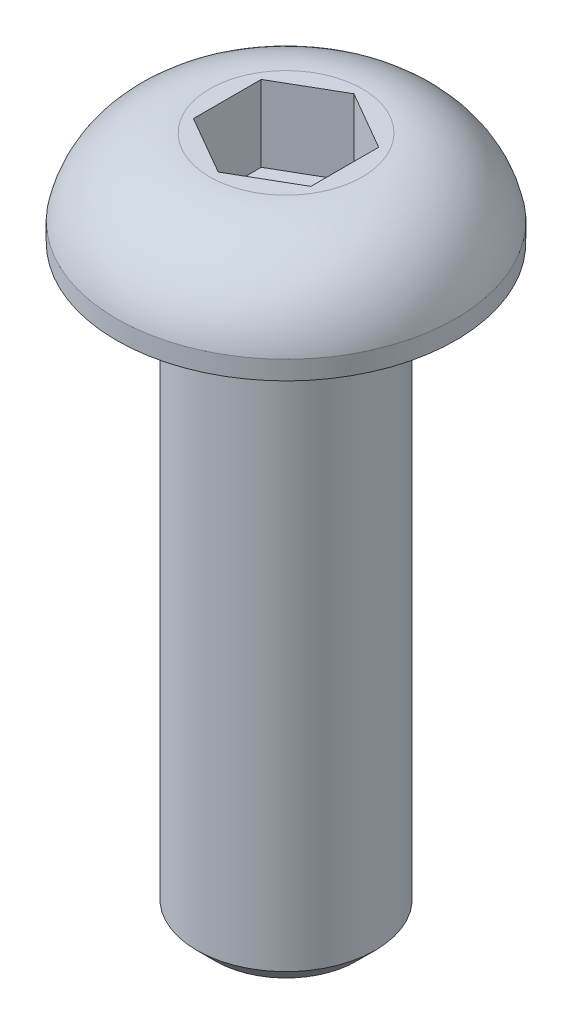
ISO-10303-21;
HEADER;
FILE_DESCRIPTION(('STEP AP214'),'2;1');
FILE_NAME('part.step','',(''),(''),'','','');
FILE_SCHEMA(('AUTOMOTIVE_DESIGN { 1 0 10303 214 1 1 1 1 }'));
ENDSEC;
DATA;
#1=APPLICATION_CONTEXT('core data for automotive mechanical design processes');
#2=APPLICATION_PROTOCOL_DEFINITION('international standard','automotive_design',2000,#1);
#3=PRODUCT_CONTEXT('',#1,'mechanical');
#4=PRODUCT('Part','Part','',(#3));
#5=PRODUCT_RELATED_PRODUCT_CATEGORY('part','',(#4));
#6=PRODUCT_DEFINITION_FORMATION('','',#4);
#7=PRODUCT_DEFINITION_CONTEXT('part definition',#1,'design');
#8=PRODUCT_DEFINITION('design','',#6,#7);
#9=PRODUCT_DEFINITION_SHAPE('','',#8);
#10=(LENGTH_UNIT() NAMED_UNIT(*) SI_UNIT(.MILLI.,.METRE.));
#11=(NAMED_UNIT(*) PLANE_ANGLE_UNIT() SI_UNIT($,.RADIAN.));
#12=(NAMED_UNIT(*) SI_UNIT($,.STERADIAN.) SOLID_ANGLE_UNIT());
#13=UNCERTAINTY_MEASURE_WITH_UNIT(LENGTH_MEASURE(1.E-05),#10,'distance_accuracy_value','');
#14=(GEOMETRIC_REPRESENTATION_CONTEXT(3) GLOBAL_UNCERTAINTY_ASSIGNED_CONTEXT((#13)) GLOBAL_UNIT_ASSIGNED_CONTEXT((#10,
#11,#12)) REPRESENTATION_CONTEXT('',''));
#15=CARTESIAN_POINT('',(0.,0.,0.));
#16=DIRECTION('',(0.,0.,1.));
#17=DIRECTION('',(1.,0.,0.));
#18=AXIS2_PLACEMENT_3D('',#15,#16,#17);
#19=CARTESIAN_POINT('',(0.,0.,0.));
#20=DIRECTION('',(0.,0.999999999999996,0.));
#21=DIRECTION('',(0.,0.,0.999999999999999));
#22=AXIS2_PLACEMENT_3D('',#19,#20,#21);
#23=PLANE('',#22);
#24=DIRECTION('',(0.,0.,0.999999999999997));
#25=VECTOR('',#24,1.);
#26=CARTESIAN_POINT('',(-1.58749999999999,0.,-0.916543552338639));
#27=LINE('',#26,#25);
#28=CARTESIAN_POINT('',(-1.58749999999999,0.,-0.916543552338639));
#29=VERTEX_POINT('',#28);
#30=CARTESIAN_POINT('',(-1.58749999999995,0.,0.916543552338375));
#31=VERTEX_POINT('',#30);
#32=EDGE_CURVE('E53',#29,#31,#27,.T.);
#33=ORIENTED_EDGE('',*,*,#32,.F.);
#34=DIRECTION('',(-0.866025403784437,0.,0.499999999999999));
#35=VECTOR('',#34,1.);
#36=CARTESIAN_POINT('',(0.,0.,-1.83308710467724));
#37=LINE('',#36,#35);
#38=CARTESIAN_POINT('',(0.,0.,-1.83308710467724));
#39=VERTEX_POINT('',#38);
#40=EDGE_CURVE('E138',#39,#29,#37,.T.);
#41=ORIENTED_EDGE('',*,*,#40,.F.);
#42=DIRECTION('',(0.866025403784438,0.,0.5));
#43=VECTOR('',#42,1.);
#44=CARTESIAN_POINT('',(0.,0.,-1.83308710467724));
#45=LINE('',#44,#43);
#46=CARTESIAN_POINT('',(1.58749999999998,0.,-0.916543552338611));
#47=VERTEX_POINT('',#46);
#48=EDGE_CURVE('E136',#39,#47,#45,.T.);
#49=ORIENTED_EDGE('',*,*,#48,.T.);
#50=DIRECTION('',(0.,0.,0.999999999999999));
#51=VECTOR('',#50,1.);
#52=CARTESIAN_POINT('',(1.58749999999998,0.,-0.916543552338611));
#53=LINE('',#52,#51);
#54=CARTESIAN_POINT('',(1.58749999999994,0.,0.916543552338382));
#55=VERTEX_POINT('',#54);
#56=EDGE_CURVE('E112',#47,#55,#53,.T.);
#57=ORIENTED_EDGE('',*,*,#56,.T.);
#58=DIRECTION('',(0.866025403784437,0.,-0.499999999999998));
#59=VECTOR('',#58,1.);
#60=CARTESIAN_POINT('',(0.,0.,1.83308710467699));
#61=LINE('',#60,#59);
#62=CARTESIAN_POINT('',(0.,0.,1.83308710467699));
#63=VERTEX_POINT('',#62);
#64=EDGE_CURVE('E132',#63,#55,#61,.T.);
#65=ORIENTED_EDGE('',*,*,#64,.F.);
#66=DIRECTION('',(-0.866025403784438,0.,-0.5));
#67=VECTOR('',#66,1.);
#68=CARTESIAN_POINT('',(0.,0.,1.83308710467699));
#69=LINE('',#68,#67);
#70=EDGE_CURVE('E128',#63,#31,#69,.T.);
#71=ORIENTED_EDGE('',*,*,#70,.T.);
#72=EDGE_LOOP('',(#33,#41,#49,#57,#65,#71));
#73=FACE_BOUND('',#72,.T.);
#74=CARTESIAN_POINT('',(0.,0.,0.));
#75=DIRECTION('',(0.,0.999999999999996,0.));
#76=DIRECTION('',(0.,0.,0.999999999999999));
#77=AXIS2_PLACEMENT_3D('',#74,#75,#76);
#78=CIRCLE('',#77,2.06375);
#79=CARTESIAN_POINT('',(0.,0.,2.06375));
#80=VERTEX_POINT('',#79);
#81=EDGE_CURVE('E156',#80,#80,#78,.T.);
#82=ORIENTED_EDGE('',*,*,#81,.T.);
#83=EDGE_LOOP('',(#82));
#84=FACE_BOUND('',#83,.T.);
#85=ADVANCED_FACE('F38',(#73,#84),#23,.T.);
#86=CARTESIAN_POINT('',(0.,-2.57317091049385,-1.11022302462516E-13));
#87=DIRECTION('',(0.,0.999999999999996,0.));
#88=DIRECTION('',(0.,0.,0.999999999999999));
#89=AXIS2_PLACEMENT_3D('',#86,#87,#88);
#90=DEGENERATE_TOROIDAL_SURFACE('',#89,2.06375,2.57317091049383,.T.);
#91=CARTESIAN_POINT('',(0.,-2.05739999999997,-1.94289029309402E-13));
#92=DIRECTION('',(0.,0.999999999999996,0.));
#93=DIRECTION('',(0.,0.,0.999999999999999));
#94=AXIS2_PLACEMENT_3D('',#91,#92,#93);
#95=CIRCLE('',#94,4.5847);
#96=CARTESIAN_POINT('',(1.24273463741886E-13,-2.05739999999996,4.58469999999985));
#97=VERTEX_POINT('',#96);
#98=EDGE_CURVE('E153',#97,#97,#95,.T.);
#99=ORIENTED_EDGE('',*,*,#98,.T.);
#100=EDGE_LOOP('',(#99));
#101=FACE_BOUND('',#100,.T.);
#102=ORIENTED_EDGE('',*,*,#81,.F.);
#103=EDGE_LOOP('',(#102));
#104=FACE_BOUND('',#103,.T.);
#105=ADVANCED_FACE('F177',(#101,#104),#90,.T.);
#106=CARTESIAN_POINT('',(1.80411241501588E-13,25.3999999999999,-2.15105711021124E-13));
#107=DIRECTION('',(0.,0.999999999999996,0.));
#108=DIRECTION('',(0.,0.,0.999999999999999));
#109=AXIS2_PLACEMENT_3D('',#106,#107,#108);
#110=CYLINDRICAL_SURFACE('',#109,4.5847);
#111=CARTESIAN_POINT('',(1.52655665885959E-13,-2.56539999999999,-1.17961196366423E-13));
#112=DIRECTION('',(0.,0.999999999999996,0.));
#113=DIRECTION('',(0.,0.,0.999999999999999));
#114=AXIS2_PLACEMENT_3D('',#111,#112,#113);
#115=CIRCLE('',#114,4.5847);
#116=CARTESIAN_POINT('',(1.23201876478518E-13,-2.56539999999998,4.58469999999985));
#117=VERTEX_POINT('',#116);
#118=EDGE_CURVE('E150',#117,#117,#115,.T.);
#119=CARTESIAN_POINT('',(1.23201876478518E-13,-2.56539999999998,4.58469999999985));
#120=CARTESIAN_POINT('',(1.23213038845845E-13,-2.56010833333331,4.58469999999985));
#121=CARTESIAN_POINT('',(1.23224201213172E-13,-2.55481666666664,4.58469999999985));
#122=CARTESIAN_POINT('',(1.23246525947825E-13,-2.54423333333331,4.58469999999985));
#123=CARTESIAN_POINT('',(1.23257688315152E-13,-2.53894166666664,4.58469999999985));
#124=CARTESIAN_POINT('',(1.23280013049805E-13,-2.52835833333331,4.58469999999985));
#125=CARTESIAN_POINT('',(1.23291175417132E-13,-2.52306666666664,4.58469999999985));
#126=CARTESIAN_POINT('',(1.23313500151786E-13,-2.51248333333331,4.58469999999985));
#127=CARTESIAN_POINT('',(1.23324662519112E-13,-2.50719166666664,4.58469999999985));
#128=CARTESIAN_POINT('',(1.23346987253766E-13,-2.49660833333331,4.58469999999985));
#129=CARTESIAN_POINT('',(1.23358149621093E-13,-2.49131666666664,4.58469999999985));
#130=CARTESIAN_POINT('',(1.23380474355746E-13,-2.48073333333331,4.58469999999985));
#131=CARTESIAN_POINT('',(1.23391636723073E-13,-2.47544166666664,4.58469999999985));
#132=CARTESIAN_POINT('',(1.23413961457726E-13,-2.46485833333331,4.58469999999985));
#133=CARTESIAN_POINT('',(1.23425123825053E-13,-2.45956666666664,4.58469999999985));
#134=CARTESIAN_POINT('',(1.23447448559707E-13,-2.44898333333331,4.58469999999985));
#135=CARTESIAN_POINT('',(1.23458610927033E-13,-2.44369166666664,4.58469999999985));
#136=CARTESIAN_POINT('',(1.23480935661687E-13,-2.43310833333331,4.58469999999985));
#137=CARTESIAN_POINT('',(1.23492098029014E-13,-2.42781666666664,4.58469999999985));
#138=CARTESIAN_POINT('',(1.23514422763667E-13,-2.4172333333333,4.58469999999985));
#139=CARTESIAN_POINT('',(1.23525585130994E-13,-2.41194166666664,4.58469999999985));
#140=CARTESIAN_POINT('',(1.23547909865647E-13,-2.4013583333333,4.58469999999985));
#141=CARTESIAN_POINT('',(1.23559072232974E-13,-2.39606666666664,4.58469999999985));
#142=CARTESIAN_POINT('',(1.23581396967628E-13,-2.3854833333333,4.58469999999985));
#143=CARTESIAN_POINT('',(1.23592559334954E-13,-2.38019166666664,4.58469999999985));
#144=CARTESIAN_POINT('',(1.23614884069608E-13,-2.3696083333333,4.58469999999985));
#145=CARTESIAN_POINT('',(1.23626046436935E-13,-2.36431666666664,4.58469999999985));
#146=CARTESIAN_POINT('',(1.23648371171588E-13,-2.3537333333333,4.58469999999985));
#147=CARTESIAN_POINT('',(1.23659533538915E-13,-2.34844166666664,4.58469999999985));
#148=CARTESIAN_POINT('',(1.23681858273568E-13,-2.3378583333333,4.58469999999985));
#149=CARTESIAN_POINT('',(1.23693020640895E-13,-2.33256666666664,4.58469999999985));
#150=CARTESIAN_POINT('',(1.23715345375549E-13,-2.32198333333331,4.58469999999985));
#151=CARTESIAN_POINT('',(1.23726507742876E-13,-2.31669166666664,4.58469999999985));
#152=CARTESIAN_POINT('',(1.23748832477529E-13,-2.3061083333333,4.58469999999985));
#153=CARTESIAN_POINT('',(1.23759994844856E-13,-2.30081666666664,4.58469999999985));
#154=CARTESIAN_POINT('',(1.23782319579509E-13,-2.2902333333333,4.58469999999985));
#155=CARTESIAN_POINT('',(1.23793481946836E-13,-2.28494166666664,4.58469999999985));
#156=CARTESIAN_POINT('',(1.2381580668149E-13,-2.2743583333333,4.58469999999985));
#157=CARTESIAN_POINT('',(1.23826969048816E-13,-2.26906666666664,4.58469999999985));
#158=CARTESIAN_POINT('',(1.2384929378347E-13,-2.2584833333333,4.58469999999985));
#159=CARTESIAN_POINT('',(1.23860456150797E-13,-2.25319166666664,4.58469999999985));
#160=CARTESIAN_POINT('',(1.2388278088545E-13,-2.2426083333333,4.58469999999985));
#161=CARTESIAN_POINT('',(1.23893943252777E-13,-2.23731666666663,4.58469999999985));
#162=CARTESIAN_POINT('',(1.2391626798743E-13,-2.2267333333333,4.58469999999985));
#163=CARTESIAN_POINT('',(1.23927430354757E-13,-2.22144166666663,4.58469999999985));
#164=CARTESIAN_POINT('',(1.23949755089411E-13,-2.2108583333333,4.58469999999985));
#165=CARTESIAN_POINT('',(1.23960917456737E-13,-2.20556666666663,4.58469999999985));
#166=CARTESIAN_POINT('',(1.23983242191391E-13,-2.1949833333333,4.58469999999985));
#167=CARTESIAN_POINT('',(1.23994404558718E-13,-2.18969166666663,4.58469999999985));
#168=CARTESIAN_POINT('',(1.24016729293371E-13,-2.1791083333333,4.58469999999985));
#169=CARTESIAN_POINT('',(1.24027891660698E-13,-2.17381666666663,4.58469999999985));
#170=CARTESIAN_POINT('',(1.24050216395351E-13,-2.1632333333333,4.58469999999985));
#171=CARTESIAN_POINT('',(1.24061378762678E-13,-2.15794166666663,4.58469999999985));
#172=CARTESIAN_POINT('',(1.24083703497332E-13,-2.1473583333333,4.58469999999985));
#173=CARTESIAN_POINT('',(1.24094865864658E-13,-2.14206666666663,4.58469999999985));
#174=CARTESIAN_POINT('',(1.24117190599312E-13,-2.13148333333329,4.58469999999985));
#175=CARTESIAN_POINT('',(1.24128352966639E-13,-2.12619166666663,4.58469999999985));
#176=CARTESIAN_POINT('',(1.24150677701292E-13,-2.11560833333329,4.58469999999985));
#177=CARTESIAN_POINT('',(1.24161840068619E-13,-2.11031666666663,4.58469999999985));
#178=CARTESIAN_POINT('',(1.24184164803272E-13,-2.09973333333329,4.58469999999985));
#179=CARTESIAN_POINT('',(1.24195327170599E-13,-2.09444166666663,4.58469999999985));
#180=CARTESIAN_POINT('',(1.24217651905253E-13,-2.08385833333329,4.58469999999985));
#181=CARTESIAN_POINT('',(1.24228814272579E-13,-2.07856666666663,4.58469999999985));
#182=CARTESIAN_POINT('',(1.24251139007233E-13,-2.06798333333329,4.58469999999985));
#183=CARTESIAN_POINT('',(1.2426230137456E-13,-2.06269166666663,4.58469999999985));
#184=CARTESIAN_POINT('',(1.24273463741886E-13,-2.05739999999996,4.58469999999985));
#185=B_SPLINE_CURVE_WITH_KNOTS('',3,(#119,#120,#121,#122,#123,#124,#125,#126,#127,#128,#129,
#130,#131,#132,#133,#134,#135,#136,#137,#138,#139,#140,#141,#142,#143,#144,#145,#146,#147,#148,
#149,#150,#151,#152,#153,#154,#155,#156,#157,#158,#159,#160,#161,#162,#163,#164,#165,#166,#167,
#168,#169,#170,#171,#172,#173,#174,#175,#176,#177,#178,#179,#180,#181,#182,#183,#184),
.UNSPECIFIED.,.F.,.F.,(4,2,2,2,2,2,2,2,2,2,2,2,2,2,2,2,2,2,2,2,2,2,2,2,2,2,2,2,2,2,2,2,4),(0.,
0.015875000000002,0.0317500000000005,0.0476250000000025,0.0635000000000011,0.0793750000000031,
0.0952500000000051,0.111125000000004,0.127000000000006,0.142875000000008,0.158750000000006,
0.174625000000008,0.19050000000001,0.206375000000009,0.222250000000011,0.238125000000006,
0.254000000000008,0.26987500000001,0.285750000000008,0.30162500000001,0.317500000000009,
0.333375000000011,0.349250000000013,0.365125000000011,0.381000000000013,0.396875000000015,
0.412750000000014,0.428625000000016,0.444500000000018,0.460375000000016,0.476250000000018,
0.492125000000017,0.508000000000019),.UNSPECIFIED.);
#186=EDGE_CURVE('BSEAM182',#117,#97,#185,.T.);
#187=ORIENTED_EDGE('',*,*,#118,.T.);
#188=ORIENTED_EDGE('',*,*,#98,.F.);
#189=ORIENTED_EDGE('',*,*,#186,.T.);
#190=ORIENTED_EDGE('',*,*,#186,.F.);
#191=EDGE_LOOP('',(#187,#189,#188,#190));
#192=FACE_BOUND('',#191,.T.);
#193=ADVANCED_FACE('F182',(#192),#110,.T.);
#194=CARTESIAN_POINT('',(2.41300000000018,-2.56539999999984,-1.94289029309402E-13));
#195=DIRECTION('',(0.,0.999999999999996,0.));
#196=DIRECTION('',(0.,0.,0.999999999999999));
#197=AXIS2_PLACEMENT_3D('',#194,#195,#196);
#198=PLANE('',#197);
#199=ORIENTED_EDGE('',*,*,#118,.F.);
#200=EDGE_LOOP('',(#199));
#201=FACE_BOUND('',#200,.T.);
#202=CARTESIAN_POINT('',(1.52655665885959E-13,-2.56539999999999,-1.17961196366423E-13));
#203=DIRECTION('',(0.,0.999999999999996,0.));
#204=DIRECTION('',(0.,0.,0.999999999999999));
#205=AXIS2_PLACEMENT_3D('',#202,#203,#204);
#206=CIRCLE('',#205,2.413);
#207=CARTESIAN_POINT('',(1.22358001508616E-13,-2.56539999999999,2.41299999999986));
#208=VERTEX_POINT('',#207);
#209=EDGE_CURVE('E142',#208,#208,#206,.T.);
#210=ORIENTED_EDGE('',*,*,#209,.T.);
#211=EDGE_LOOP('',(#210));
#212=FACE_BOUND('',#211,.T.);
#213=ADVANCED_FACE('F189',(#201,#212),#198,.F.);
#214=CARTESIAN_POINT('',(1.80411241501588E-13,25.3999999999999,-2.15105711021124E-13));
#215=DIRECTION('',(0.,0.999999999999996,0.));
#216=DIRECTION('',(0.,0.,0.999999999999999));
#217=AXIS2_PLACEMENT_3D('',#214,#215,#216);
#218=CYLINDRICAL_SURFACE('',#217,2.413);
#219=CARTESIAN_POINT('',(1.11022302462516E-13,-17.9323999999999,0.));
#220=DIRECTION('',(0.,-0.999999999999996,0.));
#221=DIRECTION('',(0.,0.,-0.999999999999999));
#222=AXIS2_PLACEMENT_3D('',#219,#220,#221);
#223=CIRCLE('',#222,2.413);
#224=CARTESIAN_POINT('',(0.,-17.9323999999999,2.41299999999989));
#225=VERTEX_POINT('',#224);
#226=EDGE_CURVE('E46',#225,#225,#223,.F.);
#227=CARTESIAN_POINT('',(0.,-17.9323999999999,2.41299999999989));
#228=CARTESIAN_POINT('',(0.,-17.7723270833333,2.41299999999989));
#229=CARTESIAN_POINT('',(0.,-17.6122541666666,2.41299999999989));
#230=CARTESIAN_POINT('',(0.,-17.2921083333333,2.41299999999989));
#231=CARTESIAN_POINT('',(0.,-17.1320354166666,2.41299999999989));
#232=CARTESIAN_POINT('',(0.,-16.8118895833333,2.41299999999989));
#233=CARTESIAN_POINT('',(0.,-16.6518166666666,2.41299999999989));
#234=CARTESIAN_POINT('',(0.,-16.3316708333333,2.41299999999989));
#235=CARTESIAN_POINT('',(0.,-16.1715979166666,2.41299999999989));
#236=CARTESIAN_POINT('',(0.,-15.8514520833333,2.41299999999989));
#237=CARTESIAN_POINT('',(0.,-15.6913791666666,2.41299999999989));
#238=CARTESIAN_POINT('',(0.,-15.3712333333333,2.41299999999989));
#239=CARTESIAN_POINT('',(0.,-15.2111604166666,2.41299999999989));
#240=CARTESIAN_POINT('',(0.,-14.8910145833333,2.41299999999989));
#241=CARTESIAN_POINT('',(0.,-14.7309416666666,2.41299999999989));
#242=CARTESIAN_POINT('',(0.,-14.4107958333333,2.41299999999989));
#243=CARTESIAN_POINT('',(0.,-14.2507229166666,2.41299999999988));
#244=CARTESIAN_POINT('',(0.,-13.9305770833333,2.41299999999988));
#245=CARTESIAN_POINT('',(0.,-13.7705041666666,2.41299999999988));
#246=CARTESIAN_POINT('',(0.,-13.4503583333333,2.41299999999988));
#247=CARTESIAN_POINT('',(0.,-13.2902854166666,2.41299999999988));
#248=CARTESIAN_POINT('',(1.00409996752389E-13,-12.9701395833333,2.41299999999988));
#249=CARTESIAN_POINT('',(1.00747658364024E-13,-12.8100666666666,2.41299999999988));
#250=CARTESIAN_POINT('',(1.01422981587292E-13,-12.4899208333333,2.41299999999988));
#251=CARTESIAN_POINT('',(1.01760643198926E-13,-12.3298479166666,2.41299999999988));
#252=CARTESIAN_POINT('',(1.02435966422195E-13,-12.0097020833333,2.41299999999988));
#253=CARTESIAN_POINT('',(1.02773628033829E-13,-11.8496291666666,2.41299999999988));
#254=CARTESIAN_POINT('',(1.03448951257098E-13,-11.5294833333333,2.41299999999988));
#255=CARTESIAN_POINT('',(1.03786612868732E-13,-11.3694104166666,2.41299999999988));
#256=CARTESIAN_POINT('',(1.04461936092E-13,-11.0492645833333,2.41299999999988));
#257=CARTESIAN_POINT('',(1.04799597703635E-13,-10.8891916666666,2.41299999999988));
#258=CARTESIAN_POINT('',(1.05474920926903E-13,-10.5690458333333,2.41299999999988));
#259=CARTESIAN_POINT('',(1.05812582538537E-13,-10.4089729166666,2.41299999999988));
#260=CARTESIAN_POINT('',(1.06487905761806E-13,-10.0888270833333,2.41299999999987));
#261=CARTESIAN_POINT('',(1.0682556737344E-13,-9.92875416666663,2.41299999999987));
#262=CARTESIAN_POINT('',(1.07500890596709E-13,-9.6086083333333,2.41299999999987));
#263=CARTESIAN_POINT('',(1.07838552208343E-13,-9.44853541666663,2.41299999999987));
#264=CARTESIAN_POINT('',(1.08513875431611E-13,-9.1283895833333,2.41299999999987));
#265=CARTESIAN_POINT('',(1.08851537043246E-13,-8.96831666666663,2.41299999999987));
#266=CARTESIAN_POINT('',(1.09526860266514E-13,-8.6481708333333,2.41299999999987));
#267=CARTESIAN_POINT('',(1.09864521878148E-13,-8.48809791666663,2.41299999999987));
#268=CARTESIAN_POINT('',(1.10539845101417E-13,-8.1679520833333,2.41299999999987));
#269=CARTESIAN_POINT('',(1.10877506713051E-13,-8.00787916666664,2.41299999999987));
#270=CARTESIAN_POINT('',(1.1155282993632E-13,-7.68773333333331,2.41299999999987));
#271=CARTESIAN_POINT('',(1.11890491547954E-13,-7.52766041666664,2.41299999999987));
#272=CARTESIAN_POINT('',(1.12565814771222E-13,-7.2075145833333,2.41299999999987));
#273=CARTESIAN_POINT('',(1.12903476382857E-13,-7.04744166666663,2.41299999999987));
#274=CARTESIAN_POINT('',(1.13578799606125E-13,-6.7272958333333,2.41299999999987));
#275=CARTESIAN_POINT('',(1.13916461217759E-13,-6.56722291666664,2.41299999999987));
#276=CARTESIAN_POINT('',(1.14591784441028E-13,-6.24707708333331,2.41299999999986));
#277=CARTESIAN_POINT('',(1.14929446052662E-13,-6.08700416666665,2.41299999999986));
#278=CARTESIAN_POINT('',(1.15604769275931E-13,-5.76685833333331,2.41299999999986));
#279=CARTESIAN_POINT('',(1.15942430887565E-13,-5.60678541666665,2.41299999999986));
#280=CARTESIAN_POINT('',(1.16617754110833E-13,-5.28663958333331,2.41299999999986));
#281=CARTESIAN_POINT('',(1.16955415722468E-13,-5.12656666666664,2.41299999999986));
#282=CARTESIAN_POINT('',(1.17630738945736E-13,-4.80642083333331,2.41299999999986));
#283=CARTESIAN_POINT('',(1.1796840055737E-13,-4.64634791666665,2.41299999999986));
#284=CARTESIAN_POINT('',(1.18643723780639E-13,-4.32620208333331,2.41299999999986));
#285=CARTESIAN_POINT('',(1.18981385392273E-13,-4.16612916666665,2.41299999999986));
#286=CARTESIAN_POINT('',(1.19656708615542E-13,-3.84598333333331,2.41299999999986));
#287=CARTESIAN_POINT('',(1.19994370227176E-13,-3.68591041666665,2.41299999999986));
#288=CARTESIAN_POINT('',(1.20669693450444E-13,-3.36576458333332,2.41299999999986));
#289=CARTESIAN_POINT('',(1.21007355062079E-13,-3.20569166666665,2.41299999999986));
#290=CARTESIAN_POINT('',(1.21682678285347E-13,-2.88554583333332,2.41299999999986));
#291=CARTESIAN_POINT('',(1.22020339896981E-13,-2.72547291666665,2.41299999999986));
#292=CARTESIAN_POINT('',(1.22358001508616E-13,-2.56539999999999,2.41299999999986));
#293=B_SPLINE_CURVE_WITH_KNOTS('',3,(#227,#228,#229,#230,#231,#232,#233,#234,#235,#236,#237,
#238,#239,#240,#241,#242,#243,#244,#245,#246,#247,#248,#249,#250,#251,#252,#253,#254,#255,#256,
#257,#258,#259,#260,#261,#262,#263,#264,#265,#266,#267,#268,#269,#270,#271,#272,#273,#274,#275,
#276,#277,#278,#279,#280,#281,#282,#283,#284,#285,#286,#287,#288,#289,#290,#291,#292),
.UNSPECIFIED.,.F.,.F.,(4,2,2,2,2,2,2,2,2,2,2,2,2,2,2,2,2,2,2,2,2,2,2,2,2,2,2,2,2,2,2,2,4),(0.,
0.48021874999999,0.960437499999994,1.44065625,1.920875,2.40109374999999,2.88131249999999,
3.36153124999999,3.84174999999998,4.32196874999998,4.80218749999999,5.28240624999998,
5.76262499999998,6.24284374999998,6.72306249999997,7.20328124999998,7.68349999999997,
8.16371874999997,8.64393749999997,9.12415624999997,9.60437499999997,10.08459375,10.5648125,
11.04503125,11.52525,12.00546875,12.4856875,12.96590625,13.446125,13.92634375,14.4065625,
14.8867812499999,15.3669999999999),.UNSPECIFIED.);
#294=EDGE_CURVE('BSEAM164',#225,#208,#293,.T.);
#295=ORIENTED_EDGE('',*,*,#226,.T.);
#296=ORIENTED_EDGE('',*,*,#209,.F.);
#297=ORIENTED_EDGE('',*,*,#294,.T.);
#298=ORIENTED_EDGE('',*,*,#294,.F.);
#299=EDGE_LOOP('',(#295,#297,#296,#298));
#300=FACE_BOUND('',#299,.T.);
#301=ADVANCED_FACE('F164',(#300),#218,.T.);
#302=CARTESIAN_POINT('',(2.41300000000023,-18.4403999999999,0.));
#303=DIRECTION('',(0.,-0.999999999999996,0.));
#304=DIRECTION('',(0.,0.,-0.999999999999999));
#305=AXIS2_PLACEMENT_3D('',#302,#303,#304);
#306=PLANE('',#305);
#307=CARTESIAN_POINT('',(0.,-18.4403999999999,0.));
#308=DIRECTION('',(0.,-0.999999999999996,0.));
#309=DIRECTION('',(0.,0.,-0.999999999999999));
#310=AXIS2_PLACEMENT_3D('',#307,#308,#309);
#311=CIRCLE('',#310,1.90500000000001);
#312=CARTESIAN_POINT('',(1.10690956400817E-13,-18.4403999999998,1.90500000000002));
#313=VERTEX_POINT('',#312);
#314=EDGE_CURVE('E11',#313,#313,#311,.T.);
#315=ORIENTED_EDGE('',*,*,#314,.T.);
#316=EDGE_LOOP('',(#315));
#317=FACE_BOUND('',#316,.T.);
#318=CARTESIAN_POINT('',(0.,-18.4403999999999,0.));
#319=DIRECTION('',(0.,-0.999999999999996,0.));
#320=DIRECTION('',(0.,0.,-0.999999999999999));
#321=AXIS2_PLACEMENT_3D('',#318,#319,#320);
#322=CIRCLE('',#321,1.1811);
#323=CARTESIAN_POINT('',(0.,-18.4403999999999,-1.18109999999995));
#324=VERTEX_POINT('',#323);
#325=EDGE_CURVE('E160',#324,#324,#322,.T.);
#326=ORIENTED_EDGE('',*,*,#325,.F.);
#327=EDGE_LOOP('',(#326));
#328=FACE_BOUND('',#327,.T.);
#329=ADVANCED_FACE('F196',(#317,#328),#306,.T.);
#330=CARTESIAN_POINT('',(-1.58750000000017,-2.05739999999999,-0.916543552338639));
#331=DIRECTION('',(-0.999999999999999,0.,0.));
#332=DIRECTION('',(0.,0.,0.999999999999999));
#333=AXIS2_PLACEMENT_3D('',#330,#331,#332);
#334=PLANE('',#333);
#335=ORIENTED_EDGE('',*,*,#32,.T.);
#336=DIRECTION('',(0.,0.999999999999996,0.));
#337=VECTOR('',#336,1.);
#338=CARTESIAN_POINT('',(-1.58749999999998,-2.05739999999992,0.916543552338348));
#339=LINE('',#338,#337);
#340=CARTESIAN_POINT('',(-1.58749999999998,-2.05739999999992,0.916543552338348));
#341=VERTEX_POINT('',#340);
#342=EDGE_CURVE('E126',#341,#31,#339,.T.);
#343=ORIENTED_EDGE('',*,*,#342,.F.);
#344=DIRECTION('',(0.,0.,0.999999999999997));
#345=VECTOR('',#344,1.);
#346=CARTESIAN_POINT('',(-1.58750000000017,-2.05739999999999,-0.916543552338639));
#347=LINE('',#346,#345);
#348=CARTESIAN_POINT('',(-1.58750000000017,-2.05739999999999,-0.916543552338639));
#349=VERTEX_POINT('',#348);
#350=EDGE_CURVE('E140',#349,#341,#347,.T.);
#351=ORIENTED_EDGE('',*,*,#350,.F.);
#352=DIRECTION('',(0.,0.999999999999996,0.));
#353=VECTOR('',#352,1.);
#354=CARTESIAN_POINT('',(-1.58750000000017,-2.05739999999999,-0.916543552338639));
#355=LINE('',#354,#353);
#356=EDGE_CURVE('E61',#349,#29,#355,.T.);
#357=ORIENTED_EDGE('',*,*,#356,.T.);
#358=EDGE_LOOP('',(#335,#343,#351,#357));
#359=FACE_BOUND('',#358,.T.);
#360=ADVANCED_FACE('F199',(#359),#334,.F.);
#361=CARTESIAN_POINT('',(0.,-2.05740000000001,-1.83308710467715));
#362=DIRECTION('',(-0.499999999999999,0.,-0.866025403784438));
#363=DIRECTION('',(-0.866025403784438,0.,0.5));
#364=AXIS2_PLACEMENT_3D('',#361,#362,#363);
#365=PLANE('',#364);
#366=ORIENTED_EDGE('',*,*,#40,.T.);
#367=ORIENTED_EDGE('',*,*,#356,.F.);
#368=DIRECTION('',(-0.866025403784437,0.,0.499999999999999));
#369=VECTOR('',#368,1.);
#370=CARTESIAN_POINT('',(0.,-2.05740000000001,-1.83308710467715));
#371=LINE('',#370,#369);
#372=CARTESIAN_POINT('',(0.,-2.05740000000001,-1.83308710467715));
#373=VERTEX_POINT('',#372);
#374=EDGE_CURVE('E105',#373,#349,#371,.T.);
#375=ORIENTED_EDGE('',*,*,#374,.F.);
#376=DIRECTION('',(0.,0.999999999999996,0.));
#377=VECTOR('',#376,1.);
#378=CARTESIAN_POINT('',(0.,-2.05740000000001,-1.83308710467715));
#379=LINE('',#378,#377);
#380=EDGE_CURVE('E101',#373,#39,#379,.T.);
#381=ORIENTED_EDGE('',*,*,#380,.T.);
#382=EDGE_LOOP('',(#366,#367,#375,#381));
#383=FACE_BOUND('',#382,.T.);
#384=ADVANCED_FACE('F203',(#383),#365,.F.);
#385=CARTESIAN_POINT('',(0.,-2.05740000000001,-1.83308710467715));
#386=DIRECTION('',(-0.499999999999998,0.,0.866025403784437));
#387=DIRECTION('',(0.866025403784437,0.,0.5));
#388=AXIS2_PLACEMENT_3D('',#385,#386,#387);
#389=PLANE('',#388);
#390=ORIENTED_EDGE('',*,*,#48,.F.);
#391=ORIENTED_EDGE('',*,*,#380,.F.);
#392=DIRECTION('',(0.866025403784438,0.,0.5));
#393=VECTOR('',#392,1.);
#394=CARTESIAN_POINT('',(0.,-2.05740000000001,-1.83308710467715));
#395=LINE('',#394,#393);
#396=CARTESIAN_POINT('',(1.58749999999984,-2.05740000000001,-0.916543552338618));
#397=VERTEX_POINT('',#396);
#398=EDGE_CURVE('E95',#373,#397,#395,.T.);
#399=ORIENTED_EDGE('',*,*,#398,.T.);
#400=DIRECTION('',(0.,0.999999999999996,0.));
#401=VECTOR('',#400,1.);
#402=CARTESIAN_POINT('',(1.58749999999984,-2.05740000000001,-0.916543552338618));
#403=LINE('',#402,#401);
#404=EDGE_CURVE('E99',#397,#47,#403,.T.);
#405=ORIENTED_EDGE('',*,*,#404,.T.);
#406=EDGE_LOOP('',(#390,#391,#399,#405));
#407=FACE_BOUND('',#406,.T.);
#408=ADVANCED_FACE('F98',(#407),#389,.T.);
#409=CARTESIAN_POINT('',(1.58749999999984,-2.05740000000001,-0.916543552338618));
#410=DIRECTION('',(-0.999999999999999,0.,0.));
#411=DIRECTION('',(0.,0.,0.999999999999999));
#412=AXIS2_PLACEMENT_3D('',#409,#410,#411);
#413=PLANE('',#412);
#414=ORIENTED_EDGE('',*,*,#56,.F.);
#415=ORIENTED_EDGE('',*,*,#404,.F.);
#416=DIRECTION('',(0.,0.,0.999999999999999));
#417=VECTOR('',#416,1.);
#418=CARTESIAN_POINT('',(1.58749999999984,-2.05740000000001,-0.916543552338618));
#419=LINE('',#418,#417);
#420=CARTESIAN_POINT('',(1.58749999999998,-2.05739999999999,0.916543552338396));
#421=VERTEX_POINT('',#420);
#422=EDGE_CURVE('E106',#397,#421,#419,.T.);
#423=ORIENTED_EDGE('',*,*,#422,.T.);
#424=DIRECTION('',(0.,0.999999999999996,0.));
#425=VECTOR('',#424,1.);
#426=CARTESIAN_POINT('',(1.58749999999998,-2.05739999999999,0.916543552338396));
#427=LINE('',#426,#425);
#428=EDGE_CURVE('E114',#421,#55,#427,.T.);
#429=ORIENTED_EDGE('',*,*,#428,.T.);
#430=EDGE_LOOP('',(#414,#415,#423,#429));
#431=FACE_BOUND('',#430,.T.);
#432=ADVANCED_FACE('F109',(#431),#413,.T.);
#433=CARTESIAN_POINT('',(0.,-2.05739999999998,1.83308710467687));
#434=DIRECTION('',(0.5,0.,0.866025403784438));
#435=DIRECTION('',(0.866025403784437,0.,-0.499999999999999));
#436=AXIS2_PLACEMENT_3D('',#433,#434,#435);
#437=PLANE('',#436);
#438=ORIENTED_EDGE('',*,*,#64,.T.);
#439=ORIENTED_EDGE('',*,*,#428,.F.);
#440=DIRECTION('',(0.866025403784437,0.,-0.499999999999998));
#441=VECTOR('',#440,1.);
#442=CARTESIAN_POINT('',(0.,-2.05739999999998,1.83308710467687));
#443=LINE('',#442,#441);
#444=CARTESIAN_POINT('',(0.,-2.05739999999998,1.83308710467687));
#445=VERTEX_POINT('',#444);
#446=EDGE_CURVE('E120',#445,#421,#443,.T.);
#447=ORIENTED_EDGE('',*,*,#446,.F.);
#448=DIRECTION('',(0.,0.999999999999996,0.));
#449=VECTOR('',#448,1.);
#450=CARTESIAN_POINT('',(0.,-2.05739999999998,1.83308710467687));
#451=LINE('',#450,#449);
#452=EDGE_CURVE('E145',#445,#63,#451,.T.);
#453=ORIENTED_EDGE('',*,*,#452,.T.);
#454=EDGE_LOOP('',(#438,#439,#447,#453));
#455=FACE_BOUND('',#454,.T.);
#456=ADVANCED_FACE('F207',(#455),#437,.F.);
#457=CARTESIAN_POINT('',(0.,-2.05739999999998,1.83308710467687));
#458=DIRECTION('',(0.499999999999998,0.,-0.866025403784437));
#459=DIRECTION('',(-0.866025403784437,0.,-0.5));
#460=AXIS2_PLACEMENT_3D('',#457,#458,#459);
#461=PLANE('',#460);
#462=ORIENTED_EDGE('',*,*,#70,.F.);
#463=ORIENTED_EDGE('',*,*,#452,.F.);
#464=DIRECTION('',(-0.866025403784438,0.,-0.5));
#465=VECTOR('',#464,1.);
#466=CARTESIAN_POINT('',(0.,-2.05739999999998,1.83308710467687));
#467=LINE('',#466,#465);
#468=EDGE_CURVE('E87',#445,#341,#467,.T.);
#469=ORIENTED_EDGE('',*,*,#468,.T.);
#470=ORIENTED_EDGE('',*,*,#342,.T.);
#471=EDGE_LOOP('',(#462,#463,#469,#470));
#472=FACE_BOUND('',#471,.T.);
#473=ADVANCED_FACE('F204',(#472),#461,.T.);
#474=CARTESIAN_POINT('',(-1.58749999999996,-2.0573999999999,2.74963065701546));
#475=DIRECTION('',(0.,0.999999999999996,0.));
#476=DIRECTION('',(0.,0.,0.999999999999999));
#477=AXIS2_PLACEMENT_3D('',#474,#475,#476);
#478=PLANE('',#477);
#479=CARTESIAN_POINT('',(0.,-2.05739999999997,-1.94289029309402E-13));
#480=DIRECTION('',(0.,0.999999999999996,0.));
#481=DIRECTION('',(0.,0.,0.999999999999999));
#482=AXIS2_PLACEMENT_3D('',#479,#480,#481);
#483=CIRCLE('',#482,1.1811);
#484=CARTESIAN_POINT('',(0.,-2.05739999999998,-1.18109999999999));
#485=VERTEX_POINT('',#484);
#486=EDGE_CURVE('E129',#485,#485,#483,.T.);
#487=ORIENTED_EDGE('',*,*,#486,.F.);
#488=EDGE_LOOP('',(#487));
#489=FACE_BOUND('',#488,.T.);
#490=ORIENTED_EDGE('',*,*,#350,.T.);
#491=ORIENTED_EDGE('',*,*,#468,.F.);
#492=ORIENTED_EDGE('',*,*,#446,.T.);
#493=ORIENTED_EDGE('',*,*,#422,.F.);
#494=ORIENTED_EDGE('',*,*,#398,.F.);
#495=ORIENTED_EDGE('',*,*,#374,.T.);
#496=EDGE_LOOP('',(#490,#491,#492,#493,#494,#495));
#497=FACE_BOUND('',#496,.T.);
#498=ADVANCED_FACE('F118',(#489,#497),#478,.T.);
#499=CARTESIAN_POINT('',(0.,0.,0.));
#500=DIRECTION('',(0.,-0.999999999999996,0.));
#501=DIRECTION('',(0.,0.,-0.999999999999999));
#502=AXIS2_PLACEMENT_3D('',#499,#500,#501);
#503=CYLINDRICAL_SURFACE('',#502,1.1811);
#504=CARTESIAN_POINT('',(0.,-2.05739999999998,-1.18109999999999));
#505=CARTESIAN_POINT('',(0.,-2.22805624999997,-1.18109999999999));
#506=CARTESIAN_POINT('',(0.,-2.39871249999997,-1.18109999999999));
#507=CARTESIAN_POINT('',(0.,-2.74002499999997,-1.18109999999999));
#508=CARTESIAN_POINT('',(0.,-2.91068124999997,-1.18109999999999));
#509=CARTESIAN_POINT('',(0.,-3.25199374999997,-1.18109999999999));
#510=CARTESIAN_POINT('',(0.,-3.42264999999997,-1.18109999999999));
#511=CARTESIAN_POINT('',(0.,-3.76396249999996,-1.18109999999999));
#512=CARTESIAN_POINT('',(0.,-3.93461874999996,-1.18109999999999));
#513=CARTESIAN_POINT('',(0.,-4.27593124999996,-1.18109999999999));
#514=CARTESIAN_POINT('',(0.,-4.44658749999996,-1.18109999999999));
#515=CARTESIAN_POINT('',(0.,-4.78789999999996,-1.18109999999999));
#516=CARTESIAN_POINT('',(0.,-4.95855624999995,-1.18109999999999));
#517=CARTESIAN_POINT('',(0.,-5.29986874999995,-1.18109999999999));
#518=CARTESIAN_POINT('',(0.,-5.47052499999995,-1.18109999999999));
#519=CARTESIAN_POINT('',(0.,-5.81183749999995,-1.18109999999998));
#520=CARTESIAN_POINT('',(0.,-5.98249374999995,-1.18109999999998));
#521=CARTESIAN_POINT('',(0.,-6.32380624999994,-1.18109999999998));
#522=CARTESIAN_POINT('',(0.,-6.49446249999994,-1.18109999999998));
#523=CARTESIAN_POINT('',(0.,-6.83577499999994,-1.18109999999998));
#524=CARTESIAN_POINT('',(0.,-7.00643124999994,-1.18109999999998));
#525=CARTESIAN_POINT('',(0.,-7.34774374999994,-1.18109999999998));
#526=CARTESIAN_POINT('',(0.,-7.51839999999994,-1.18109999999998));
#527=CARTESIAN_POINT('',(0.,-7.85971249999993,-1.18109999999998));
#528=CARTESIAN_POINT('',(0.,-8.03036874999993,-1.18109999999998));
#529=CARTESIAN_POINT('',(0.,-8.37168124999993,-1.18109999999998));
#530=CARTESIAN_POINT('',(0.,-8.54233749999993,-1.18109999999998));
#531=CARTESIAN_POINT('',(0.,-8.88364999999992,-1.18109999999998));
#532=CARTESIAN_POINT('',(0.,-9.05430624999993,-1.18109999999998));
#533=CARTESIAN_POINT('',(0.,-9.39561874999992,-1.18109999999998));
#534=CARTESIAN_POINT('',(0.,-9.56627499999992,-1.18109999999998));
#535=CARTESIAN_POINT('',(0.,-9.90758749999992,-1.18109999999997));
#536=CARTESIAN_POINT('',(0.,-10.0782437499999,-1.18109999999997));
#537=CARTESIAN_POINT('',(0.,-10.4195562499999,-1.18109999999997));
#538=CARTESIAN_POINT('',(0.,-10.5902124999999,-1.18109999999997));
#539=CARTESIAN_POINT('',(0.,-10.9315249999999,-1.18109999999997));
#540=CARTESIAN_POINT('',(0.,-11.1021812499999,-1.18109999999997));
#541=CARTESIAN_POINT('',(0.,-11.4434937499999,-1.18109999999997));
#542=CARTESIAN_POINT('',(0.,-11.6141499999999,-1.18109999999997));
#543=CARTESIAN_POINT('',(0.,-11.9554624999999,-1.18109999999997));
#544=CARTESIAN_POINT('',(0.,-12.1261187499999,-1.18109999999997));
#545=CARTESIAN_POINT('',(0.,-12.4674312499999,-1.18109999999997));
#546=CARTESIAN_POINT('',(0.,-12.6380874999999,-1.18109999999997));
#547=CARTESIAN_POINT('',(0.,-12.9793999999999,-1.18109999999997));
#548=CARTESIAN_POINT('',(0.,-13.1500562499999,-1.18109999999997));
#549=CARTESIAN_POINT('',(0.,-13.4913687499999,-1.18109999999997));
#550=CARTESIAN_POINT('',(0.,-13.6620249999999,-1.18109999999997));
#551=CARTESIAN_POINT('',(0.,-14.0033374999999,-1.18109999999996));
#552=CARTESIAN_POINT('',(0.,-14.1739937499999,-1.18109999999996));
#553=CARTESIAN_POINT('',(0.,-14.5153062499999,-1.18109999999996));
#554=CARTESIAN_POINT('',(0.,-14.6859624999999,-1.18109999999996));
#555=CARTESIAN_POINT('',(0.,-15.0272749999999,-1.18109999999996));
#556=CARTESIAN_POINT('',(0.,-15.1979312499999,-1.18109999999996));
#557=CARTESIAN_POINT('',(0.,-15.5392437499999,-1.18109999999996));
#558=CARTESIAN_POINT('',(0.,-15.7098999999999,-1.18109999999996));
#559=CARTESIAN_POINT('',(0.,-16.0512124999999,-1.18109999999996));
#560=CARTESIAN_POINT('',(0.,-16.2218687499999,-1.18109999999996));
#561=CARTESIAN_POINT('',(0.,-16.5631812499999,-1.18109999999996));
#562=CARTESIAN_POINT('',(0.,-16.7338374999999,-1.18109999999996));
#563=CARTESIAN_POINT('',(0.,-17.0751499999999,-1.18109999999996));
#564=CARTESIAN_POINT('',(0.,-17.2458062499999,-1.18109999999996));
#565=CARTESIAN_POINT('',(0.,-17.5871187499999,-1.18109999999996));
#566=CARTESIAN_POINT('',(0.,-17.7577749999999,-1.18109999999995));
#567=CARTESIAN_POINT('',(0.,-18.0990874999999,-1.18109999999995));
#568=CARTESIAN_POINT('',(0.,-18.2697437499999,-1.18109999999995));
#569=CARTESIAN_POINT('',(0.,-18.4403999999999,-1.18109999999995));
#570=B_SPLINE_CURVE_WITH_KNOTS('',3,(#504,#505,#506,#507,#508,#509,#510,#511,#512,#513,#514,
#515,#516,#517,#518,#519,#520,#521,#522,#523,#524,#525,#526,#527,#528,#529,#530,#531,#532,#533,
#534,#535,#536,#537,#538,#539,#540,#541,#542,#543,#544,#545,#546,#547,#548,#549,#550,#551,#552,
#553,#554,#555,#556,#557,#558,#559,#560,#561,#562,#563,#564,#565,#566,#567,#568,#569),
.UNSPECIFIED.,.F.,.F.,(4,2,2,2,2,2,2,2,2,2,2,2,2,2,2,2,2,2,2,2,2,2,2,2,2,2,2,2,2,2,2,2,4),(0.,
0.511968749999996,1.02393749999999,1.53590624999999,2.04787499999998,2.55984374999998,
3.07181249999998,3.58378124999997,4.09574999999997,4.60771874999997,5.11968749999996,
5.63165624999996,6.14362499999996,6.65559374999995,7.16756249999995,7.67953124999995,
8.19149999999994,8.70346874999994,9.21543749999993,9.72740624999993,10.2393749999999,
10.7513437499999,11.2633124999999,11.7752812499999,12.2872499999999,12.7992187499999,
13.3111874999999,13.8231562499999,14.3351249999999,14.8470937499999,15.3590624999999,
15.8710312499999,16.3829999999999),.UNSPECIFIED.);
#571=EDGE_CURVE('BSEAM168',#485,#324,#570,.T.);
#572=ORIENTED_EDGE('',*,*,#486,.T.);
#573=ORIENTED_EDGE('',*,*,#325,.T.);
#574=ORIENTED_EDGE('',*,*,#571,.T.);
#575=ORIENTED_EDGE('',*,*,#571,.F.);
#576=EDGE_LOOP('',(#572,#574,#573,#575));
#577=FACE_BOUND('',#576,.T.);
#578=ADVANCED_FACE('F168',(#577),#503,.F.);
#579=CARTESIAN_POINT('',(1.11022302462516E-13,-17.9323999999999,0.));
#580=DIRECTION('',(0.,0.999999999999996,0.));
#581=DIRECTION('',(0.,0.,0.999999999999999));
#582=AXIS2_PLACEMENT_3D('',#579,#580,#581);
#583=CONICAL_SURFACE('',#582,2.413,0.785398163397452);
#584=CARTESIAN_POINT('',(1.10690956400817E-13,-18.4403999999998,1.90500000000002));
#585=CARTESIAN_POINT('',(1.10704174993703E-13,-18.4351083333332,1.91029166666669));
#586=CARTESIAN_POINT('',(1.1071739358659E-13,-18.4298166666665,1.91558333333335));
#587=CARTESIAN_POINT('',(1.10743830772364E-13,-18.4192333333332,1.92616666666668));
#588=CARTESIAN_POINT('',(1.10757049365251E-13,-18.4139416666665,1.93145833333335));
#589=CARTESIAN_POINT('',(1.10783486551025E-13,-18.4033583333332,1.94204166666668));
#590=CARTESIAN_POINT('',(1.10796705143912E-13,-18.3980666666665,1.94733333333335));
#591=CARTESIAN_POINT('',(1.10823142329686E-13,-18.3874833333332,1.95791666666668));
#592=CARTESIAN_POINT('',(1.10836360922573E-13,-18.3821916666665,1.96320833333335));
#593=CARTESIAN_POINT('',(1.10862798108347E-13,-18.3716083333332,1.97379166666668));
#594=CARTESIAN_POINT('',(1.10876016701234E-13,-18.3663166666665,1.97908333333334));
#595=CARTESIAN_POINT('',(1.10902453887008E-13,-18.3557333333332,1.98966666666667));
#596=CARTESIAN_POINT('',(1.10915672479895E-13,-18.3504416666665,1.99495833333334));
#597=CARTESIAN_POINT('',(1.10942109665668E-13,-18.3398583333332,2.00554166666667));
#598=CARTESIAN_POINT('',(1.10955328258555E-13,-18.3345666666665,2.01083333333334));
#599=CARTESIAN_POINT('',(1.10981765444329E-13,-18.3239833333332,2.02141666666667));
#600=CARTESIAN_POINT('',(1.10994984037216E-13,-18.3186916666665,2.02670833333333));
#601=CARTESIAN_POINT('',(1.1102142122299E-13,-18.3081083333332,2.03729166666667));
#602=CARTESIAN_POINT('',(1.11034639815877E-13,-18.3028166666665,2.04258333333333));
#603=CARTESIAN_POINT('',(1.11061077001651E-13,-18.2922333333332,2.05316666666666));
#604=CARTESIAN_POINT('',(1.11074295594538E-13,-18.2869416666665,2.05845833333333));
#605=CARTESIAN_POINT('',(1.11100732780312E-13,-18.2763583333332,2.06904166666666));
#606=CARTESIAN_POINT('',(1.11113951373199E-13,-18.2710666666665,2.07433333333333));
#607=CARTESIAN_POINT('',(1.11140388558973E-13,-18.2604833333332,2.08491666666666));
#608=CARTESIAN_POINT('',(1.11153607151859E-13,-18.2551916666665,2.09020833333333));
#609=CARTESIAN_POINT('',(1.11180044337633E-13,-18.2446083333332,2.10079166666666));
#610=CARTESIAN_POINT('',(1.1119326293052E-13,-18.2393166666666,2.10608333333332));
#611=CARTESIAN_POINT('',(1.11219700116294E-13,-18.2287333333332,2.11666666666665));
#612=CARTESIAN_POINT('',(1.11232918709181E-13,-18.2234416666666,2.12195833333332));
#613=CARTESIAN_POINT('',(1.11259355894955E-13,-18.2128583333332,2.13254166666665));
#614=CARTESIAN_POINT('',(1.11272574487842E-13,-18.2075666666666,2.13783333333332));
#615=CARTESIAN_POINT('',(1.11299011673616E-13,-18.1969833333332,2.14841666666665));
#616=CARTESIAN_POINT('',(1.11312230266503E-13,-18.1916916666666,2.15370833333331));
#617=CARTESIAN_POINT('',(1.11338667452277E-13,-18.1811083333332,2.16429166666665));
#618=CARTESIAN_POINT('',(1.11351886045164E-13,-18.1758166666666,2.16958333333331));
#619=CARTESIAN_POINT('',(1.11378323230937E-13,-18.1652333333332,2.18016666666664));
#620=CARTESIAN_POINT('',(1.11391541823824E-13,-18.1599416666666,2.18545833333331));
#621=CARTESIAN_POINT('',(1.11417979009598E-13,-18.1493583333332,2.19604166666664));
#622=CARTESIAN_POINT('',(1.11431197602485E-13,-18.1440666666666,2.20133333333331));
#623=CARTESIAN_POINT('',(1.11457634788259E-13,-18.1334833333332,2.21191666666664));
#624=CARTESIAN_POINT('',(1.11470853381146E-13,-18.1281916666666,2.2172083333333));
#625=CARTESIAN_POINT('',(1.1149729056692E-13,-18.1176083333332,2.22779166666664));
#626=CARTESIAN_POINT('',(1.11510509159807E-13,-18.1123166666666,2.2330833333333));
#627=CARTESIAN_POINT('',(1.11536946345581E-13,-18.1017333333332,2.24366666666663));
#628=CARTESIAN_POINT('',(1.11550164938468E-13,-18.0964416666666,2.2489583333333));
#629=CARTESIAN_POINT('',(1.11576602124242E-13,-18.0858583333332,2.25954166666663));
#630=CARTESIAN_POINT('',(1.11589820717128E-13,-18.0805666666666,2.2648333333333));
#631=CARTESIAN_POINT('',(1.11616257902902E-13,-18.0699833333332,2.27541666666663));
#632=CARTESIAN_POINT('',(1.11629476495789E-13,-18.0646916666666,2.28070833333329));
#633=CARTESIAN_POINT('',(1.11655913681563E-13,-18.0541083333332,2.29129166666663));
#634=CARTESIAN_POINT('',(1.1166913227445E-13,-18.0488166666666,2.29658333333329));
#635=CARTESIAN_POINT('',(1.11695569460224E-13,-18.0382333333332,2.30716666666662));
#636=CARTESIAN_POINT('',(1.11708788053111E-13,-18.0329416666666,2.31245833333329));
#637=CARTESIAN_POINT('',(1.11735225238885E-13,-18.0223583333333,2.32304166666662));
#638=CARTESIAN_POINT('',(1.11748443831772E-13,-18.0170666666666,2.32833333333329));
#639=CARTESIAN_POINT('',(1.11774881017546E-13,-18.0064833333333,2.33891666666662));
#640=CARTESIAN_POINT('',(1.11788099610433E-13,-18.0011916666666,2.34420833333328));
#641=CARTESIAN_POINT('',(1.11814536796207E-13,-17.9906083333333,2.35479166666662));
#642=CARTESIAN_POINT('',(1.11827755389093E-13,-17.9853166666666,2.36008333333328));
#643=CARTESIAN_POINT('',(1.11854192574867E-13,-17.9747333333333,2.37066666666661));
#644=CARTESIAN_POINT('',(1.11867411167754E-13,-17.9694416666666,2.37595833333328));
#645=CARTESIAN_POINT('',(1.11893848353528E-13,-17.9588583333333,2.38654166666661));
#646=CARTESIAN_POINT('',(1.11907066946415E-13,-17.9535666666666,2.39183333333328));
#647=CARTESIAN_POINT('',(1.11933504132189E-13,-17.9429833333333,2.40241666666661));
#648=CARTESIAN_POINT('',(1.11946722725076E-13,-17.9376916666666,2.40770833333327));
#649=CARTESIAN_POINT('',(1.11959941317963E-13,-17.9323999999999,2.41299999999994));
#650=B_SPLINE_CURVE_WITH_KNOTS('',3,(#584,#585,#586,#587,#588,#589,#590,#591,#592,#593,#594,
#595,#596,#597,#598,#599,#600,#601,#602,#603,#604,#605,#606,#607,#608,#609,#610,#611,#612,#613,
#614,#615,#616,#617,#618,#619,#620,#621,#622,#623,#624,#625,#626,#627,#628,#629,#630,#631,#632,
#633,#634,#635,#636,#637,#638,#639,#640,#641,#642,#643,#644,#645,#646,#647,#648,#649),
.UNSPECIFIED.,.F.,.F.,(4,2,2,2,2,2,2,2,2,2,2,2,2,2,2,2,2,2,2,2,2,2,2,2,2,2,2,2,2,2,2,2,4),(0.,
0.0224506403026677,0.0449012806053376,0.0673519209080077,0.0898025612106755,0.112253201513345,
0.134703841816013,0.157154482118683,0.179605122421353,0.202055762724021,0.224506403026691,
0.246957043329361,0.269407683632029,0.291858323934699,0.314308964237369,0.336759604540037,
0.359210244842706,0.381660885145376,0.404111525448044,0.426562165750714,0.449012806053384,
0.471463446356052,0.493914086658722,0.516364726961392,0.53881536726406,0.56126600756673,
0.5837166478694,0.606167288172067,0.628617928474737,0.651068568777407,0.673519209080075,
0.695969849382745,0.718420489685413),.UNSPECIFIED.);
#651=EDGE_CURVE('BSEAM40',#313,#225,#650,.T.);
#652=ORIENTED_EDGE('',*,*,#314,.F.);
#653=ORIENTED_EDGE('',*,*,#226,.F.);
#654=ORIENTED_EDGE('',*,*,#651,.T.);
#655=ORIENTED_EDGE('',*,*,#651,.F.);
#656=EDGE_LOOP('',(#652,#654,#653,#655));
#657=FACE_BOUND('',#656,.T.);
#658=ADVANCED_FACE('F40',(#657),#583,.T.);
#659=CLOSED_SHELL('',(#85,#105,#193,#213,#301,#329,#360,#384,#408,#432,#456,#473,#498,#578,#658));
#660=MANIFOLD_SOLID_BREP('B2',#659);
#661=ADVANCED_BREP_SHAPE_REPRESENTATION('',(#18,#660),#14);
#662=SHAPE_DEFINITION_REPRESENTATION(#9,#661);
ENDSEC;
END-ISO-10303-21;
